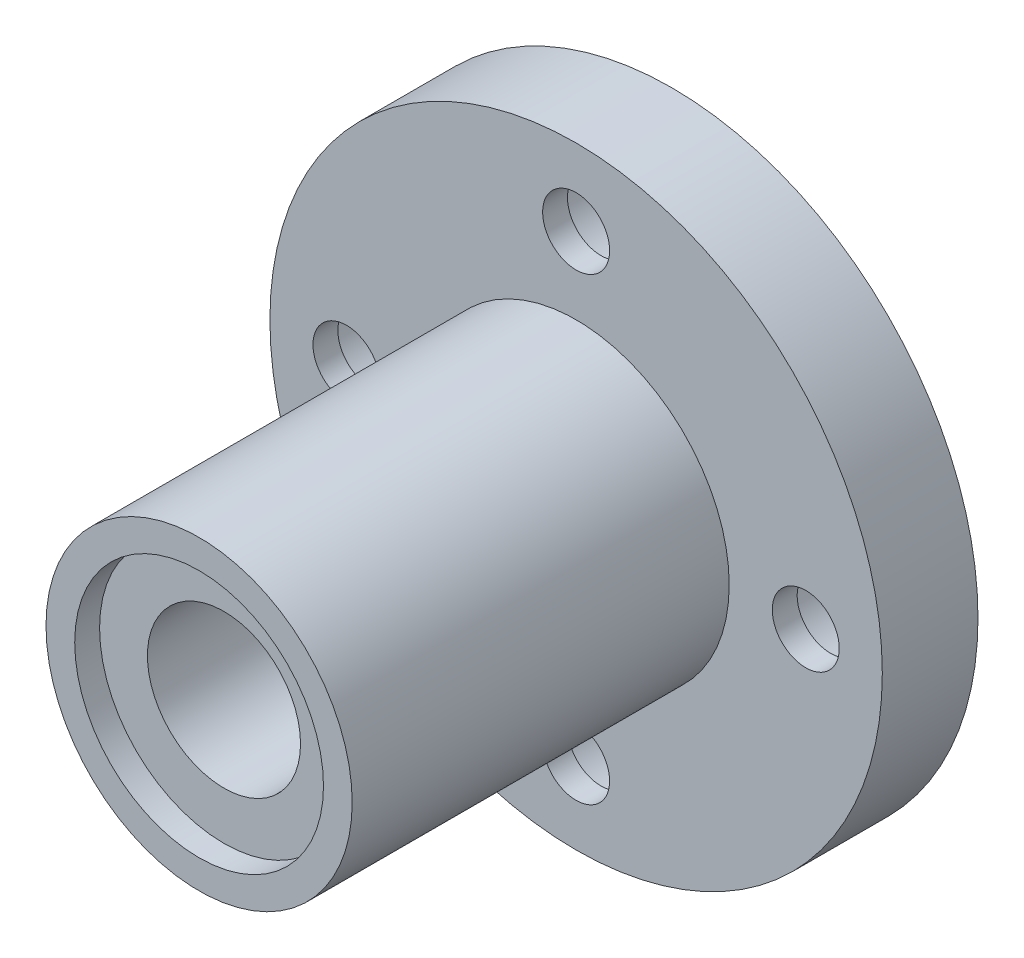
ISO-10303-21;
HEADER;
FILE_DESCRIPTION(('STEP AP214'),'2;1');
FILE_NAME('part.step','',(''),(''),'','','');
FILE_SCHEMA(('AUTOMOTIVE_DESIGN { 1 0 10303 214 1 1 1 1 }'));
ENDSEC;
DATA;
#1=APPLICATION_CONTEXT('core data for automotive mechanical design processes');
#2=APPLICATION_PROTOCOL_DEFINITION('international standard','automotive_design',2000,#1);
#3=PRODUCT_CONTEXT('',#1,'mechanical');
#4=PRODUCT('Part','Part','',(#3));
#5=PRODUCT_RELATED_PRODUCT_CATEGORY('part','',(#4));
#6=PRODUCT_DEFINITION_FORMATION('','',#4);
#7=PRODUCT_DEFINITION_CONTEXT('part definition',#1,'design');
#8=PRODUCT_DEFINITION('design','',#6,#7);
#9=PRODUCT_DEFINITION_SHAPE('','',#8);
#10=(LENGTH_UNIT() NAMED_UNIT(*) SI_UNIT(.MILLI.,.METRE.));
#11=(NAMED_UNIT(*) PLANE_ANGLE_UNIT() SI_UNIT($,.RADIAN.));
#12=(NAMED_UNIT(*) SI_UNIT($,.STERADIAN.) SOLID_ANGLE_UNIT());
#13=UNCERTAINTY_MEASURE_WITH_UNIT(LENGTH_MEASURE(1.E-05),#10,'distance_accuracy_value','');
#14=(GEOMETRIC_REPRESENTATION_CONTEXT(3) GLOBAL_UNCERTAINTY_ASSIGNED_CONTEXT((#13)) GLOBAL_UNIT_ASSIGNED_CONTEXT((#10,
#11,#12)) REPRESENTATION_CONTEXT('',''));
#15=CARTESIAN_POINT('',(0.,0.,0.));
#16=DIRECTION('',(0.,0.,1.));
#17=DIRECTION('',(1.,0.,0.));
#18=AXIS2_PLACEMENT_3D('',#15,#16,#17);
#19=CARTESIAN_POINT('',(0.,0.,-0.001000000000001));
#20=DIRECTION('',(0.,0.,1.));
#21=DIRECTION('',(1.,0.,0.));
#22=AXIS2_PLACEMENT_3D('',#19,#20,#21);
#23=CYLINDRICAL_SURFACE('',#22,4.);
#24=CARTESIAN_POINT('',(0.,0.,1.3));
#25=DIRECTION('',(0.,0.,1.));
#26=DIRECTION('',(1.,0.,0.));
#27=AXIS2_PLACEMENT_3D('',#24,#25,#26);
#28=CIRCLE('',#27,4.);
#29=CARTESIAN_POINT('',(4.,0.,1.3));
#30=VERTEX_POINT('',#29);
#31=EDGE_CURVE('E41',#30,#30,#28,.F.);
#32=ORIENTED_EDGE('',*,*,#31,.T.);
#33=EDGE_LOOP('',(#32));
#34=FACE_BOUND('',#33,.T.);
#35=CARTESIAN_POINT('',(0.,0.,23.4));
#36=DIRECTION('',(0.,0.,1.));
#37=DIRECTION('',(1.,0.,0.));
#38=AXIS2_PLACEMENT_3D('',#35,#36,#37);
#39=CIRCLE('',#38,4.);
#40=CARTESIAN_POINT('',(4.,0.,23.4));
#41=VERTEX_POINT('',#40);
#42=EDGE_CURVE('E57',#41,#41,#39,.F.);
#43=ORIENTED_EDGE('',*,*,#42,.F.);
#44=EDGE_LOOP('',(#43));
#45=FACE_BOUND('',#44,.T.);
#46=ADVANCED_FACE('F37',(#34,#45),#23,.F.);
#47=CARTESIAN_POINT('',(12.,0.,24.701));
#48=DIRECTION('',(0.,0.,-1.));
#49=DIRECTION('',(-1.,0.,0.));
#50=AXIS2_PLACEMENT_3D('',#47,#48,#49);
#51=CYLINDRICAL_SURFACE('',#50,1.75);
#52=CARTESIAN_POINT('',(12.,0.,5.));
#53=DIRECTION('',(0.,0.,1.));
#54=DIRECTION('',(1.,0.,0.));
#55=AXIS2_PLACEMENT_3D('',#52,#53,#54);
#56=CIRCLE('',#55,1.75);
#57=CARTESIAN_POINT('',(13.75,0.,5.));
#58=VERTEX_POINT('',#57);
#59=EDGE_CURVE('E85',#58,#58,#56,.F.);
#60=ORIENTED_EDGE('',*,*,#59,.F.);
#61=EDGE_LOOP('',(#60));
#62=FACE_BOUND('',#61,.T.);
#63=CARTESIAN_POINT('',(12.,0.,3.7));
#64=DIRECTION('',(0.,0.,-1.));
#65=DIRECTION('',(-1.,0.,0.));
#66=AXIS2_PLACEMENT_3D('',#63,#64,#65);
#67=CIRCLE('',#66,1.75);
#68=CARTESIAN_POINT('',(10.25,0.,3.7));
#69=VERTEX_POINT('',#68);
#70=EDGE_CURVE('E59',#69,#69,#67,.T.);
#71=ORIENTED_EDGE('',*,*,#70,.T.);
#72=EDGE_LOOP('',(#71));
#73=FACE_BOUND('',#72,.T.);
#74=ADVANCED_FACE('F124',(#62,#73),#51,.F.);
#75=CARTESIAN_POINT('',(0.,-12.,24.701));
#76=DIRECTION('',(0.,0.,-1.));
#77=DIRECTION('',(-1.,0.,0.));
#78=AXIS2_PLACEMENT_3D('',#75,#76,#77);
#79=CYLINDRICAL_SURFACE('',#78,1.75);
#80=CARTESIAN_POINT('',(0.,-12.,5.));
#81=DIRECTION('',(0.,0.,1.));
#82=DIRECTION('',(1.,0.,0.));
#83=AXIS2_PLACEMENT_3D('',#80,#81,#82);
#84=CIRCLE('',#83,1.75);
#85=CARTESIAN_POINT('',(1.75,-12.,5.));
#86=VERTEX_POINT('',#85);
#87=EDGE_CURVE('E116',#86,#86,#84,.F.);
#88=ORIENTED_EDGE('',*,*,#87,.F.);
#89=EDGE_LOOP('',(#88));
#90=FACE_BOUND('',#89,.T.);
#91=CARTESIAN_POINT('',(0.,-12.,3.7));
#92=DIRECTION('',(0.,0.,-1.));
#93=DIRECTION('',(-1.,0.,0.));
#94=AXIS2_PLACEMENT_3D('',#91,#92,#93);
#95=CIRCLE('',#94,1.75);
#96=CARTESIAN_POINT('',(-1.75,-12.,3.7));
#97=VERTEX_POINT('',#96);
#98=EDGE_CURVE('E97',#97,#97,#95,.T.);
#99=ORIENTED_EDGE('',*,*,#98,.T.);
#100=EDGE_LOOP('',(#99));
#101=FACE_BOUND('',#100,.T.);
#102=ADVANCED_FACE('F127',(#90,#101),#79,.F.);
#103=CARTESIAN_POINT('',(-12.,0.,24.701));
#104=DIRECTION('',(0.,0.,-1.));
#105=DIRECTION('',(-1.,0.,0.));
#106=AXIS2_PLACEMENT_3D('',#103,#104,#105);
#107=CYLINDRICAL_SURFACE('',#106,1.75);
#108=CARTESIAN_POINT('',(-12.,0.,5.));
#109=DIRECTION('',(0.,0.,1.));
#110=DIRECTION('',(1.,0.,0.));
#111=AXIS2_PLACEMENT_3D('',#108,#109,#110);
#112=CIRCLE('',#111,1.75);
#113=CARTESIAN_POINT('',(-10.25,0.,5.));
#114=VERTEX_POINT('',#113);
#115=EDGE_CURVE('E113',#114,#114,#112,.F.);
#116=ORIENTED_EDGE('',*,*,#115,.F.);
#117=EDGE_LOOP('',(#116));
#118=FACE_BOUND('',#117,.T.);
#119=CARTESIAN_POINT('',(-12.,0.,3.7));
#120=DIRECTION('',(0.,0.,-1.));
#121=DIRECTION('',(-1.,0.,0.));
#122=AXIS2_PLACEMENT_3D('',#119,#120,#121);
#123=CIRCLE('',#122,1.75);
#124=CARTESIAN_POINT('',(-13.75,0.,3.7));
#125=VERTEX_POINT('',#124);
#126=EDGE_CURVE('E88',#125,#125,#123,.T.);
#127=ORIENTED_EDGE('',*,*,#126,.T.);
#128=EDGE_LOOP('',(#127));
#129=FACE_BOUND('',#128,.T.);
#130=ADVANCED_FACE('F161',(#118,#129),#107,.F.);
#131=CARTESIAN_POINT('',(0.,12.,24.701));
#132=DIRECTION('',(0.,0.,-1.));
#133=DIRECTION('',(-1.,0.,0.));
#134=AXIS2_PLACEMENT_3D('',#131,#132,#133);
#135=CYLINDRICAL_SURFACE('',#134,1.75);
#136=CARTESIAN_POINT('',(0.,12.,5.));
#137=DIRECTION('',(0.,0.,1.));
#138=DIRECTION('',(1.,0.,0.));
#139=AXIS2_PLACEMENT_3D('',#136,#137,#138);
#140=CIRCLE('',#139,1.75);
#141=CARTESIAN_POINT('',(1.75,12.,5.));
#142=VERTEX_POINT('',#141);
#143=EDGE_CURVE('E110',#142,#142,#140,.F.);
#144=ORIENTED_EDGE('',*,*,#143,.F.);
#145=EDGE_LOOP('',(#144));
#146=FACE_BOUND('',#145,.T.);
#147=CARTESIAN_POINT('',(0.,12.,3.7));
#148=DIRECTION('',(0.,0.,-1.));
#149=DIRECTION('',(-1.,0.,0.));
#150=AXIS2_PLACEMENT_3D('',#147,#148,#149);
#151=CIRCLE('',#150,1.75);
#152=CARTESIAN_POINT('',(-1.75,12.,3.7));
#153=VERTEX_POINT('',#152);
#154=EDGE_CURVE('E77',#153,#153,#151,.T.);
#155=ORIENTED_EDGE('',*,*,#154,.T.);
#156=EDGE_LOOP('',(#155));
#157=FACE_BOUND('',#156,.T.);
#158=ADVANCED_FACE('F153',(#146,#157),#135,.F.);
#159=CARTESIAN_POINT('',(0.,0.,5.));
#160=DIRECTION('',(0.,0.,-1.));
#161=DIRECTION('',(-1.,0.,0.));
#162=AXIS2_PLACEMENT_3D('',#159,#160,#161);
#163=CYLINDRICAL_SURFACE('',#162,16.);
#164=CARTESIAN_POINT('',(0.,0.,5.));
#165=DIRECTION('',(0.,0.,1.));
#166=DIRECTION('',(1.,0.,0.));
#167=AXIS2_PLACEMENT_3D('',#164,#165,#166);
#168=CIRCLE('',#167,16.);
#169=CARTESIAN_POINT('',(16.,0.,5.));
#170=VERTEX_POINT('',#169);
#171=EDGE_CURVE('E45',#170,#170,#168,.T.);
#172=ORIENTED_EDGE('',*,*,#171,.F.);
#173=EDGE_LOOP('',(#172));
#174=FACE_BOUND('',#173,.T.);
#175=CARTESIAN_POINT('',(0.,0.,0.));
#176=DIRECTION('',(0.,0.,1.));
#177=DIRECTION('',(1.,0.,0.));
#178=AXIS2_PLACEMENT_3D('',#175,#176,#177);
#179=CIRCLE('',#178,16.);
#180=CARTESIAN_POINT('',(16.,0.,0.));
#181=VERTEX_POINT('',#180);
#182=EDGE_CURVE('E50',#181,#181,#179,.T.);
#183=ORIENTED_EDGE('',*,*,#182,.T.);
#184=EDGE_LOOP('',(#183));
#185=FACE_BOUND('',#184,.T.);
#186=ADVANCED_FACE('F39',(#174,#185),#163,.T.);
#187=CARTESIAN_POINT('',(0.,0.,5.));
#188=DIRECTION('',(0.,0.,1.));
#189=DIRECTION('',(1.,0.,0.));
#190=AXIS2_PLACEMENT_3D('',#187,#188,#189);
#191=PLANE('',#190);
#192=ORIENTED_EDGE('',*,*,#143,.T.);
#193=EDGE_LOOP('',(#192));
#194=FACE_BOUND('',#193,.T.);
#195=ORIENTED_EDGE('',*,*,#115,.T.);
#196=EDGE_LOOP('',(#195));
#197=FACE_BOUND('',#196,.T.);
#198=ORIENTED_EDGE('',*,*,#87,.T.);
#199=EDGE_LOOP('',(#198));
#200=FACE_BOUND('',#199,.T.);
#201=ORIENTED_EDGE('',*,*,#59,.T.);
#202=EDGE_LOOP('',(#201));
#203=FACE_BOUND('',#202,.T.);
#204=CARTESIAN_POINT('',(0.,0.,5.));
#205=DIRECTION('',(0.,0.,1.));
#206=DIRECTION('',(1.,0.,0.));
#207=AXIS2_PLACEMENT_3D('',#204,#205,#206);
#208=CIRCLE('',#207,8.);
#209=CARTESIAN_POINT('',(8.,0.,5.));
#210=VERTEX_POINT('',#209);
#211=EDGE_CURVE('E10',#210,#210,#208,.T.);
#212=ORIENTED_EDGE('',*,*,#211,.F.);
#213=EDGE_LOOP('',(#212));
#214=FACE_BOUND('',#213,.T.);
#215=ORIENTED_EDGE('',*,*,#171,.T.);
#216=EDGE_LOOP('',(#215));
#217=FACE_BOUND('',#216,.T.);
#218=ADVANCED_FACE('F121',(#194,#197,#200,#203,#214,#217),#191,.T.);
#219=CARTESIAN_POINT('',(0.,0.,0.));
#220=DIRECTION('',(0.,0.,1.));
#221=DIRECTION('',(1.,0.,0.));
#222=AXIS2_PLACEMENT_3D('',#219,#220,#221);
#223=PLANE('',#222);
#224=CARTESIAN_POINT('',(0.,0.,0.));
#225=DIRECTION('',(0.,0.,1.));
#226=DIRECTION('',(1.,0.,0.));
#227=AXIS2_PLACEMENT_3D('',#224,#225,#226);
#228=CIRCLE('',#227,6.5);
#229=CARTESIAN_POINT('',(6.5,0.,0.));
#230=VERTEX_POINT('',#229);
#231=EDGE_CURVE('E74',#230,#230,#228,.T.);
#232=ORIENTED_EDGE('',*,*,#231,.T.);
#233=EDGE_LOOP('',(#232));
#234=FACE_BOUND('',#233,.T.);
#235=CARTESIAN_POINT('',(0.,12.,0.));
#236=DIRECTION('',(0.,0.,-1.));
#237=DIRECTION('',(-1.,0.,0.));
#238=AXIS2_PLACEMENT_3D('',#235,#236,#237);
#239=CIRCLE('',#238,3.25);
#240=CARTESIAN_POINT('',(-3.25,12.,0.));
#241=VERTEX_POINT('',#240);
#242=EDGE_CURVE('E80',#241,#241,#239,.T.);
#243=ORIENTED_EDGE('',*,*,#242,.F.);
#244=EDGE_LOOP('',(#243));
#245=FACE_BOUND('',#244,.T.);
#246=CARTESIAN_POINT('',(-12.,0.,0.));
#247=DIRECTION('',(0.,0.,-1.));
#248=DIRECTION('',(-1.,0.,0.));
#249=AXIS2_PLACEMENT_3D('',#246,#247,#248);
#250=CIRCLE('',#249,3.25);
#251=CARTESIAN_POINT('',(-15.25,0.,0.));
#252=VERTEX_POINT('',#251);
#253=EDGE_CURVE('E91',#252,#252,#250,.T.);
#254=ORIENTED_EDGE('',*,*,#253,.F.);
#255=EDGE_LOOP('',(#254));
#256=FACE_BOUND('',#255,.T.);
#257=CARTESIAN_POINT('',(0.,-12.,0.));
#258=DIRECTION('',(0.,0.,-1.));
#259=DIRECTION('',(-1.,0.,0.));
#260=AXIS2_PLACEMENT_3D('',#257,#258,#259);
#261=CIRCLE('',#260,3.25);
#262=CARTESIAN_POINT('',(-3.25,-12.,0.));
#263=VERTEX_POINT('',#262);
#264=EDGE_CURVE('E100',#263,#263,#261,.T.);
#265=ORIENTED_EDGE('',*,*,#264,.F.);
#266=EDGE_LOOP('',(#265));
#267=FACE_BOUND('',#266,.T.);
#268=CARTESIAN_POINT('',(12.,0.,0.));
#269=DIRECTION('',(0.,0.,-1.));
#270=DIRECTION('',(-1.,0.,0.));
#271=AXIS2_PLACEMENT_3D('',#268,#269,#270);
#272=CIRCLE('',#271,3.25);
#273=CARTESIAN_POINT('',(8.75,0.,0.));
#274=VERTEX_POINT('',#273);
#275=EDGE_CURVE('E64',#274,#274,#272,.T.);
#276=ORIENTED_EDGE('',*,*,#275,.F.);
#277=EDGE_LOOP('',(#276));
#278=FACE_BOUND('',#277,.T.);
#279=ORIENTED_EDGE('',*,*,#182,.F.);
#280=EDGE_LOOP('',(#279));
#281=FACE_BOUND('',#280,.T.);
#282=ADVANCED_FACE('F145',(#234,#245,#256,#267,#278,#281),#223,.F.);
#283=CARTESIAN_POINT('',(0.,0.,24.7));
#284=DIRECTION('',(0.,0.,-1.));
#285=DIRECTION('',(-1.,0.,0.));
#286=AXIS2_PLACEMENT_3D('',#283,#284,#285);
#287=CYLINDRICAL_SURFACE('',#286,8.);
#288=CARTESIAN_POINT('',(0.,0.,24.7));
#289=DIRECTION('',(0.,0.,1.));
#290=DIRECTION('',(1.,0.,0.));
#291=AXIS2_PLACEMENT_3D('',#288,#289,#290);
#292=CIRCLE('',#291,8.);
#293=CARTESIAN_POINT('',(8.,0.,24.7));
#294=VERTEX_POINT('',#293);
#295=EDGE_CURVE('E53',#294,#294,#292,.T.);
#296=ORIENTED_EDGE('',*,*,#295,.F.);
#297=EDGE_LOOP('',(#296));
#298=FACE_BOUND('',#297,.T.);
#299=ORIENTED_EDGE('',*,*,#211,.T.);
#300=EDGE_LOOP('',(#299));
#301=FACE_BOUND('',#300,.T.);
#302=ADVANCED_FACE('F148',(#298,#301),#287,.T.);
#303=CARTESIAN_POINT('',(0.,0.,24.7));
#304=DIRECTION('',(0.,0.,1.));
#305=DIRECTION('',(1.,0.,0.));
#306=AXIS2_PLACEMENT_3D('',#303,#304,#305);
#307=PLANE('',#306);
#308=CARTESIAN_POINT('',(0.,0.,24.7));
#309=DIRECTION('',(0.,0.,1.));
#310=DIRECTION('',(1.,0.,0.));
#311=AXIS2_PLACEMENT_3D('',#308,#309,#310);
#312=CIRCLE('',#311,6.5);
#313=CARTESIAN_POINT('',(6.5,0.,24.7));
#314=VERTEX_POINT('',#313);
#315=EDGE_CURVE('E67',#314,#314,#312,.T.);
#316=ORIENTED_EDGE('',*,*,#315,.F.);
#317=EDGE_LOOP('',(#316));
#318=FACE_BOUND('',#317,.T.);
#319=ORIENTED_EDGE('',*,*,#295,.T.);
#320=EDGE_LOOP('',(#319));
#321=FACE_BOUND('',#320,.T.);
#322=ADVANCED_FACE('F174',(#318,#321),#307,.T.);
#323=CARTESIAN_POINT('',(0.,12.,3.7));
#324=DIRECTION('',(0.,0.,-1.));
#325=DIRECTION('',(-1.,0.,0.));
#326=AXIS2_PLACEMENT_3D('',#323,#324,#325);
#327=CYLINDRICAL_SURFACE('',#326,3.25);
#328=CARTESIAN_POINT('',(0.,12.,3.7));
#329=DIRECTION('',(0.,0.,-1.));
#330=DIRECTION('',(-1.,0.,0.));
#331=AXIS2_PLACEMENT_3D('',#328,#329,#330);
#332=CIRCLE('',#331,3.25);
#333=CARTESIAN_POINT('',(-3.25,12.,3.7));
#334=VERTEX_POINT('',#333);
#335=EDGE_CURVE('E82',#334,#334,#332,.T.);
#336=ORIENTED_EDGE('',*,*,#335,.F.);
#337=EDGE_LOOP('',(#336));
#338=FACE_BOUND('',#337,.T.);
#339=ORIENTED_EDGE('',*,*,#242,.T.);
#340=EDGE_LOOP('',(#339));
#341=FACE_BOUND('',#340,.T.);
#342=ADVANCED_FACE('F177',(#338,#341),#327,.F.);
#343=CARTESIAN_POINT('',(0.,12.,3.7));
#344=DIRECTION('',(0.,0.,-1.));
#345=DIRECTION('',(-1.,0.,0.));
#346=AXIS2_PLACEMENT_3D('',#343,#344,#345);
#347=PLANE('',#346);
#348=ORIENTED_EDGE('',*,*,#154,.F.);
#349=EDGE_LOOP('',(#348));
#350=FACE_BOUND('',#349,.T.);
#351=ORIENTED_EDGE('',*,*,#335,.T.);
#352=EDGE_LOOP('',(#351));
#353=FACE_BOUND('',#352,.T.);
#354=ADVANCED_FACE('F201',(#350,#353),#347,.T.);
#355=CARTESIAN_POINT('',(-12.,0.,3.7));
#356=DIRECTION('',(0.,0.,-1.));
#357=DIRECTION('',(-1.,0.,0.));
#358=AXIS2_PLACEMENT_3D('',#355,#356,#357);
#359=CYLINDRICAL_SURFACE('',#358,3.25);
#360=CARTESIAN_POINT('',(-12.,0.,3.7));
#361=DIRECTION('',(0.,0.,-1.));
#362=DIRECTION('',(-1.,0.,0.));
#363=AXIS2_PLACEMENT_3D('',#360,#361,#362);
#364=CIRCLE('',#363,3.25);
#365=CARTESIAN_POINT('',(-15.25,0.,3.7));
#366=VERTEX_POINT('',#365);
#367=EDGE_CURVE('E81',#366,#366,#364,.T.);
#368=ORIENTED_EDGE('',*,*,#367,.F.);
#369=EDGE_LOOP('',(#368));
#370=FACE_BOUND('',#369,.T.);
#371=ORIENTED_EDGE('',*,*,#253,.T.);
#372=EDGE_LOOP('',(#371));
#373=FACE_BOUND('',#372,.T.);
#374=ADVANCED_FACE('F210',(#370,#373),#359,.F.);
#375=CARTESIAN_POINT('',(-12.,0.,3.7));
#376=DIRECTION('',(0.,0.,-1.));
#377=DIRECTION('',(-1.,0.,0.));
#378=AXIS2_PLACEMENT_3D('',#375,#376,#377);
#379=PLANE('',#378);
#380=ORIENTED_EDGE('',*,*,#126,.F.);
#381=EDGE_LOOP('',(#380));
#382=FACE_BOUND('',#381,.T.);
#383=ORIENTED_EDGE('',*,*,#367,.T.);
#384=EDGE_LOOP('',(#383));
#385=FACE_BOUND('',#384,.T.);
#386=ADVANCED_FACE('F218',(#382,#385),#379,.T.);
#387=CARTESIAN_POINT('',(0.,-12.,3.7));
#388=DIRECTION('',(0.,0.,-1.));
#389=DIRECTION('',(-1.,0.,0.));
#390=AXIS2_PLACEMENT_3D('',#387,#388,#389);
#391=CYLINDRICAL_SURFACE('',#390,3.25);
#392=CARTESIAN_POINT('',(0.,-12.,3.7));
#393=DIRECTION('',(0.,0.,-1.));
#394=DIRECTION('',(-1.,0.,0.));
#395=AXIS2_PLACEMENT_3D('',#392,#393,#394);
#396=CIRCLE('',#395,3.25);
#397=CARTESIAN_POINT('',(-3.25,-12.,3.7));
#398=VERTEX_POINT('',#397);
#399=EDGE_CURVE('E92',#398,#398,#396,.T.);
#400=ORIENTED_EDGE('',*,*,#399,.F.);
#401=EDGE_LOOP('',(#400));
#402=FACE_BOUND('',#401,.T.);
#403=ORIENTED_EDGE('',*,*,#264,.T.);
#404=EDGE_LOOP('',(#403));
#405=FACE_BOUND('',#404,.T.);
#406=ADVANCED_FACE('F226',(#402,#405),#391,.F.);
#407=CARTESIAN_POINT('',(0.,-12.,3.7));
#408=DIRECTION('',(0.,0.,-1.));
#409=DIRECTION('',(-1.,0.,0.));
#410=AXIS2_PLACEMENT_3D('',#407,#408,#409);
#411=PLANE('',#410);
#412=ORIENTED_EDGE('',*,*,#98,.F.);
#413=EDGE_LOOP('',(#412));
#414=FACE_BOUND('',#413,.T.);
#415=ORIENTED_EDGE('',*,*,#399,.T.);
#416=EDGE_LOOP('',(#415));
#417=FACE_BOUND('',#416,.T.);
#418=ADVANCED_FACE('F141',(#414,#417),#411,.T.);
#419=CARTESIAN_POINT('',(12.,0.,3.7));
#420=DIRECTION('',(0.,0.,-1.));
#421=DIRECTION('',(-1.,0.,0.));
#422=AXIS2_PLACEMENT_3D('',#419,#420,#421);
#423=CYLINDRICAL_SURFACE('',#422,3.25);
#424=CARTESIAN_POINT('',(12.,0.,3.7));
#425=DIRECTION('',(0.,0.,-1.));
#426=DIRECTION('',(-1.,0.,0.));
#427=AXIS2_PLACEMENT_3D('',#424,#425,#426);
#428=CIRCLE('',#427,3.25);
#429=CARTESIAN_POINT('',(8.75,0.,3.7));
#430=VERTEX_POINT('',#429);
#431=EDGE_CURVE('E101',#430,#430,#428,.T.);
#432=ORIENTED_EDGE('',*,*,#431,.F.);
#433=EDGE_LOOP('',(#432));
#434=FACE_BOUND('',#433,.T.);
#435=ORIENTED_EDGE('',*,*,#275,.T.);
#436=EDGE_LOOP('',(#435));
#437=FACE_BOUND('',#436,.T.);
#438=ADVANCED_FACE('F135',(#434,#437),#423,.F.);
#439=CARTESIAN_POINT('',(12.,0.,3.7));
#440=DIRECTION('',(0.,0.,-1.));
#441=DIRECTION('',(-1.,0.,0.));
#442=AXIS2_PLACEMENT_3D('',#439,#440,#441);
#443=PLANE('',#442);
#444=ORIENTED_EDGE('',*,*,#70,.F.);
#445=EDGE_LOOP('',(#444));
#446=FACE_BOUND('',#445,.T.);
#447=ORIENTED_EDGE('',*,*,#431,.T.);
#448=EDGE_LOOP('',(#447));
#449=FACE_BOUND('',#448,.T.);
#450=ADVANCED_FACE('F131',(#446,#449),#443,.T.);
#451=CARTESIAN_POINT('',(0.,0.,23.4));
#452=DIRECTION('',(0.,0.,1.));
#453=DIRECTION('',(1.,0.,0.));
#454=AXIS2_PLACEMENT_3D('',#451,#452,#453);
#455=PLANE('',#454);
#456=CARTESIAN_POINT('',(0.,0.,23.4));
#457=DIRECTION('',(0.,0.,1.));
#458=DIRECTION('',(1.,0.,0.));
#459=AXIS2_PLACEMENT_3D('',#456,#457,#458);
#460=CIRCLE('',#459,6.5);
#461=CARTESIAN_POINT('',(6.5,0.,23.4));
#462=VERTEX_POINT('',#461);
#463=EDGE_CURVE('E60',#462,#462,#460,.T.);
#464=ORIENTED_EDGE('',*,*,#463,.T.);
#465=EDGE_LOOP('',(#464));
#466=FACE_BOUND('',#465,.T.);
#467=ORIENTED_EDGE('',*,*,#42,.T.);
#468=EDGE_LOOP('',(#467));
#469=FACE_BOUND('',#468,.T.);
#470=ADVANCED_FACE('F134',(#466,#469),#455,.T.);
#471=CARTESIAN_POINT('',(0.,0.,23.4));
#472=DIRECTION('',(0.,0.,1.));
#473=DIRECTION('',(1.,0.,0.));
#474=AXIS2_PLACEMENT_3D('',#471,#472,#473);
#475=CYLINDRICAL_SURFACE('',#474,6.5);
#476=ORIENTED_EDGE('',*,*,#463,.F.);
#477=EDGE_LOOP('',(#476));
#478=FACE_BOUND('',#477,.T.);
#479=ORIENTED_EDGE('',*,*,#315,.T.);
#480=EDGE_LOOP('',(#479));
#481=FACE_BOUND('',#480,.T.);
#482=ADVANCED_FACE('F255',(#478,#481),#475,.F.);
#483=CARTESIAN_POINT('',(0.,0.,1.3));
#484=DIRECTION('',(0.,0.,1.));
#485=DIRECTION('',(1.,0.,0.));
#486=AXIS2_PLACEMENT_3D('',#483,#484,#485);
#487=PLANE('',#486);
#488=CARTESIAN_POINT('',(0.,0.,1.3));
#489=DIRECTION('',(0.,0.,1.));
#490=DIRECTION('',(1.,0.,0.));
#491=AXIS2_PLACEMENT_3D('',#488,#489,#490);
#492=CIRCLE('',#491,6.5);
#493=CARTESIAN_POINT('',(6.5,0.,1.3));
#494=VERTEX_POINT('',#493);
#495=EDGE_CURVE('E380',#494,#494,#492,.T.);
#496=ORIENTED_EDGE('',*,*,#495,.F.);
#497=EDGE_LOOP('',(#496));
#498=FACE_BOUND('',#497,.T.);
#499=ORIENTED_EDGE('',*,*,#31,.F.);
#500=EDGE_LOOP('',(#499));
#501=FACE_BOUND('',#500,.T.);
#502=ADVANCED_FACE('F263',(#498,#501),#487,.F.);
#503=CARTESIAN_POINT('',(0.,0.,1.3));
#504=DIRECTION('',(0.,0.,-1.));
#505=DIRECTION('',(-1.,0.,0.));
#506=AXIS2_PLACEMENT_3D('',#503,#504,#505);
#507=CYLINDRICAL_SURFACE('',#506,6.5);
#508=ORIENTED_EDGE('',*,*,#495,.T.);
#509=EDGE_LOOP('',(#508));
#510=FACE_BOUND('',#509,.T.);
#511=ORIENTED_EDGE('',*,*,#231,.F.);
#512=EDGE_LOOP('',(#511));
#513=FACE_BOUND('',#512,.T.);
#514=ADVANCED_FACE('F270',(#510,#513),#507,.F.);
#515=CLOSED_SHELL('',(#46,#74,#102,#130,#158,#186,#218,#282,#302,#322,#342,#354,#374,#386,#406,
#418,#438,#450,#470,#482,#502,#514));
#516=MANIFOLD_SOLID_BREP('B2',#515);
#517=ADVANCED_BREP_SHAPE_REPRESENTATION('',(#18,#516),#14);
#518=SHAPE_DEFINITION_REPRESENTATION(#9,#517);
ENDSEC;
END-ISO-10303-21;
